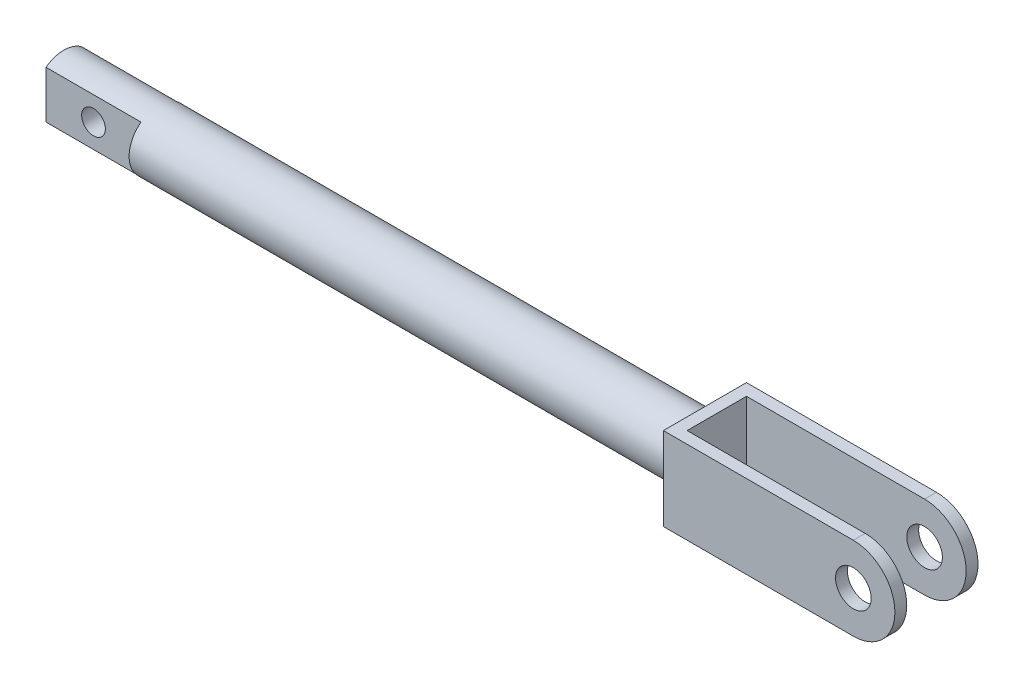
from build123d import *

# Parameters (mm, degrees)
EXTRUDE1_DEPTH      = 250
EXTRUDE1_DEPTH_BACK = 20
SKETCH1_R           = 12.5
SKETCH3_R           = 7.5
EXTRUDE2_DEPTH      = 17.5
SKETCH4_W           = 40
SKETCH4_H           = 5
CUT_EXTRUDE1_DEPTH  = 350.696296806
SKETCH6_R           = 5
CUT_EXTRUDE2_DEPTH  = 349.837354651


with BuildPart() as part:
    # Sketch1 → Extrude1 (new, two sides: drawn at the far end of the back side and taken through both)
    with BuildSketch(Plane(origin=(0, 0, 0), x_dir=(0, 0, -1), z_dir=(1, 0, 0)).offset(-EXTRUDE1_DEPTH_BACK)):
        Circle(SKETCH1_R)
    extrude(amount=EXTRUDE1_DEPTH + EXTRUDE1_DEPTH_BACK)

    # Sketch3 → Extrude2 (add, symmetric)
    with BuildSketch(Plane.XY):
        with BuildLine():
            Line((250, 17.5), (250, -17.5))
            Line((250, -17.5), (330, -17.5))
            ThreePointArc((330, -17.5), (347.5, 0), (330, 17.5))
            Line((330, 17.5), (250, 17.5))
        make_face()
        with Locations((330, 0)):
            Circle(SKETCH3_R, mode=Mode.SUBTRACT)
    extrude(amount=EXTRUDE2_DEPTH, both=True)

    # Sketch4 → Cut-Extrude1 (cut, through all)
    with BuildSketch(Plane(origin=(0, 17.5, 0), x_dir=(-1, 0, 0), z_dir=(0, 1, 0))):
        Polygon((-347.5, -12.5), (-347.5, 12.5), (-330, 12.5), (-255, 12.5), (-255, -12.5), (-330, -12.5), align=None)
        with Locations((0, -10)):
            Rectangle(SKETCH4_W, SKETCH4_H)
        with Locations((0, 10)):
            Rectangle(SKETCH4_W, SKETCH4_H)
    extrude(amount=-CUT_EXTRUDE1_DEPTH, mode=Mode.SUBTRACT)

    # Sketch6 → Cut-Extrude2 (cut, through all)
    with BuildSketch(Plane.XY.offset(7.5)):
        Circle(SKETCH6_R)
    extrude(amount=-CUT_EXTRUDE2_DEPTH, mode=Mode.SUBTRACT)


solid = part.part
